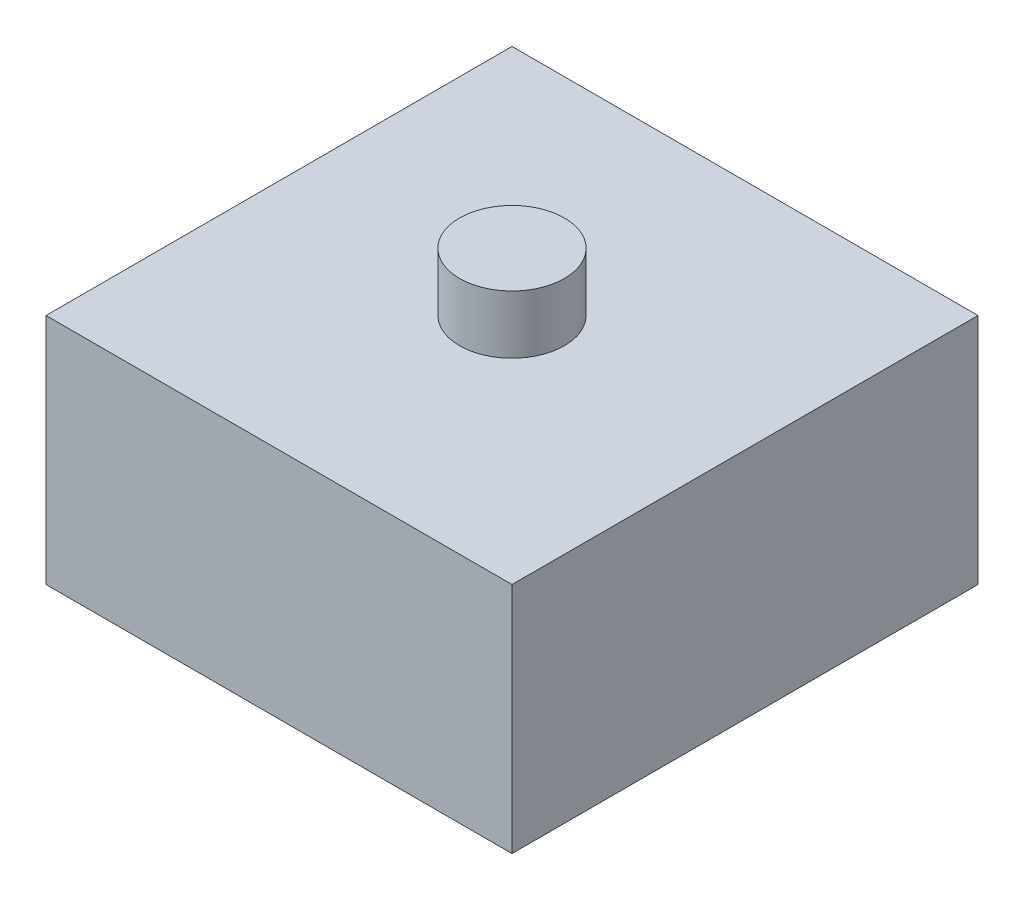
ISO-10303-21;
HEADER;
FILE_DESCRIPTION(('STEP AP214'),'2;1');
FILE_NAME('part.step','',(''),(''),'','','');
FILE_SCHEMA(('AUTOMOTIVE_DESIGN { 1 0 10303 214 1 1 1 1 }'));
ENDSEC;
DATA;
#1=APPLICATION_CONTEXT('core data for automotive mechanical design processes');
#2=APPLICATION_PROTOCOL_DEFINITION('international standard','automotive_design',2000,#1);
#3=PRODUCT_CONTEXT('',#1,'mechanical');
#4=PRODUCT('Part','Part','',(#3));
#5=PRODUCT_RELATED_PRODUCT_CATEGORY('part','',(#4));
#6=PRODUCT_DEFINITION_FORMATION('','',#4);
#7=PRODUCT_DEFINITION_CONTEXT('part definition',#1,'design');
#8=PRODUCT_DEFINITION('design','',#6,#7);
#9=PRODUCT_DEFINITION_SHAPE('','',#8);
#10=(LENGTH_UNIT() NAMED_UNIT(*) SI_UNIT(.MILLI.,.METRE.));
#11=(NAMED_UNIT(*) PLANE_ANGLE_UNIT() SI_UNIT($,.RADIAN.));
#12=(NAMED_UNIT(*) SI_UNIT($,.STERADIAN.) SOLID_ANGLE_UNIT());
#13=UNCERTAINTY_MEASURE_WITH_UNIT(LENGTH_MEASURE(1.E-05),#10,'distance_accuracy_value','');
#14=(GEOMETRIC_REPRESENTATION_CONTEXT(3) GLOBAL_UNCERTAINTY_ASSIGNED_CONTEXT((#13)) GLOBAL_UNIT_ASSIGNED_CONTEXT((#10,
#11,#12)) REPRESENTATION_CONTEXT('',''));
#15=CARTESIAN_POINT('',(0.,0.,0.));
#16=DIRECTION('',(0.,0.,1.));
#17=DIRECTION('',(1.,0.,0.));
#18=AXIS2_PLACEMENT_3D('',#15,#16,#17);
#19=CARTESIAN_POINT('',(-303.811551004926,-137.598737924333,400.));
#20=DIRECTION('',(0.,1.,0.));
#21=DIRECTION('',(0.,0.,1.));
#22=AXIS2_PLACEMENT_3D('',#19,#20,#21);
#23=PLANE('',#22);
#24=DIRECTION('',(1.,0.,0.));
#25=VECTOR('',#24,1.);
#26=CARTESIAN_POINT('',(-303.811551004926,-137.598737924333,0.));
#27=LINE('',#26,#25);
#28=CARTESIAN_POINT('',(-303.811551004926,-137.598737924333,0.));
#29=VERTEX_POINT('',#28);
#30=CARTESIAN_POINT('',(96.1884489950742,-137.598737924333,0.));
#31=VERTEX_POINT('',#30);
#32=EDGE_CURVE('E100',#29,#31,#27,.T.);
#33=ORIENTED_EDGE('',*,*,#32,.T.);
#34=DIRECTION('',(0.,0.,-1.));
#35=VECTOR('',#34,1.);
#36=CARTESIAN_POINT('',(96.1884489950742,-137.598737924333,400.));
#37=LINE('',#36,#35);
#38=CARTESIAN_POINT('',(96.1884489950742,-137.598737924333,400.));
#39=VERTEX_POINT('',#38);
#40=EDGE_CURVE('E38',#39,#31,#37,.T.);
#41=ORIENTED_EDGE('',*,*,#40,.F.);
#42=DIRECTION('',(1.,0.,0.));
#43=VECTOR('',#42,1.);
#44=CARTESIAN_POINT('',(-303.811551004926,-137.598737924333,400.));
#45=LINE('',#44,#43);
#46=CARTESIAN_POINT('',(-303.811551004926,-137.598737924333,400.));
#47=VERTEX_POINT('',#46);
#48=EDGE_CURVE('E76',#47,#39,#45,.T.);
#49=ORIENTED_EDGE('',*,*,#48,.F.);
#50=DIRECTION('',(0.,0.,-1.));
#51=VECTOR('',#50,1.);
#52=CARTESIAN_POINT('',(-303.811551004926,-137.598737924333,400.));
#53=LINE('',#52,#51);
#54=EDGE_CURVE('E96',#47,#29,#53,.T.);
#55=ORIENTED_EDGE('',*,*,#54,.T.);
#56=EDGE_LOOP('',(#33,#41,#49,#55));
#57=FACE_BOUND('',#56,.T.);
#58=ADVANCED_FACE('F35',(#57),#23,.F.);
#59=CARTESIAN_POINT('',(96.1884489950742,62.4012620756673,400.));
#60=DIRECTION('',(1.,0.,0.));
#61=DIRECTION('',(0.,1.,0.));
#62=AXIS2_PLACEMENT_3D('',#59,#60,#61);
#63=PLANE('',#62);
#64=DIRECTION('',(0.,-1.,0.));
#65=VECTOR('',#64,1.);
#66=CARTESIAN_POINT('',(96.1884489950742,62.4012620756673,0.));
#67=LINE('',#66,#65);
#68=CARTESIAN_POINT('',(96.1884489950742,62.4012620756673,0.));
#69=VERTEX_POINT('',#68);
#70=EDGE_CURVE('E86',#69,#31,#67,.T.);
#71=ORIENTED_EDGE('',*,*,#70,.F.);
#72=DIRECTION('',(0.,0.,-1.));
#73=VECTOR('',#72,1.);
#74=CARTESIAN_POINT('',(96.1884489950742,62.4012620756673,400.));
#75=LINE('',#74,#73);
#76=CARTESIAN_POINT('',(96.1884489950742,62.4012620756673,400.));
#77=VERTEX_POINT('',#76);
#78=EDGE_CURVE('E82',#77,#69,#75,.T.);
#79=ORIENTED_EDGE('',*,*,#78,.F.);
#80=DIRECTION('',(0.,-1.,0.));
#81=VECTOR('',#80,1.);
#82=CARTESIAN_POINT('',(96.1884489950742,62.4012620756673,400.));
#83=LINE('',#82,#81);
#84=EDGE_CURVE('E84',#77,#39,#83,.T.);
#85=ORIENTED_EDGE('',*,*,#84,.T.);
#86=ORIENTED_EDGE('',*,*,#40,.T.);
#87=EDGE_LOOP('',(#71,#79,#85,#86));
#88=FACE_BOUND('',#87,.T.);
#89=ADVANCED_FACE('F83',(#88),#63,.T.);
#90=CARTESIAN_POINT('',(-303.811551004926,62.4012620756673,400.));
#91=DIRECTION('',(0.,1.,0.));
#92=DIRECTION('',(0.,0.,1.));
#93=AXIS2_PLACEMENT_3D('',#90,#91,#92);
#94=PLANE('',#93);
#95=CARTESIAN_POINT('',(-103.811551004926,62.4012620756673,200.));
#96=DIRECTION('',(0.,1.,0.));
#97=DIRECTION('',(0.,0.,1.));
#98=AXIS2_PLACEMENT_3D('',#95,#96,#97);
#99=CIRCLE('',#98,45.);
#100=CARTESIAN_POINT('',(-103.811551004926,62.4012620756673,245.));
#101=VERTEX_POINT('',#100);
#102=EDGE_CURVE('E11',#101,#101,#99,.T.);
#103=ORIENTED_EDGE('',*,*,#102,.F.);
#104=EDGE_LOOP('',(#103));
#105=FACE_BOUND('',#104,.T.);
#106=DIRECTION('',(1.,0.,0.));
#107=VECTOR('',#106,1.);
#108=CARTESIAN_POINT('',(-303.811551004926,62.4012620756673,0.));
#109=LINE('',#108,#107);
#110=CARTESIAN_POINT('',(-303.811551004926,62.4012620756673,0.));
#111=VERTEX_POINT('',#110);
#112=EDGE_CURVE('E105',#111,#69,#109,.T.);
#113=ORIENTED_EDGE('',*,*,#112,.F.);
#114=DIRECTION('',(0.,0.,-1.));
#115=VECTOR('',#114,1.);
#116=CARTESIAN_POINT('',(-303.811551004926,62.4012620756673,400.));
#117=LINE('',#116,#115);
#118=CARTESIAN_POINT('',(-303.811551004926,62.4012620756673,400.));
#119=VERTEX_POINT('',#118);
#120=EDGE_CURVE('E68',#119,#111,#117,.T.);
#121=ORIENTED_EDGE('',*,*,#120,.F.);
#122=DIRECTION('',(1.,0.,0.));
#123=VECTOR('',#122,1.);
#124=CARTESIAN_POINT('',(-303.811551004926,62.4012620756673,400.));
#125=LINE('',#124,#123);
#126=EDGE_CURVE('E92',#119,#77,#125,.T.);
#127=ORIENTED_EDGE('',*,*,#126,.T.);
#128=ORIENTED_EDGE('',*,*,#78,.T.);
#129=EDGE_LOOP('',(#113,#121,#127,#128));
#130=FACE_BOUND('',#129,.T.);
#131=ADVANCED_FACE('F94',(#105,#130),#94,.T.);
#132=CARTESIAN_POINT('',(-303.811551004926,62.4012620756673,400.));
#133=DIRECTION('',(1.,0.,0.));
#134=DIRECTION('',(0.,0.,-1.));
#135=AXIS2_PLACEMENT_3D('',#132,#133,#134);
#136=PLANE('',#135);
#137=DIRECTION('',(0.,-1.,0.));
#138=VECTOR('',#137,1.);
#139=CARTESIAN_POINT('',(-303.811551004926,62.4012620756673,0.));
#140=LINE('',#139,#138);
#141=EDGE_CURVE('E71',#111,#29,#140,.T.);
#142=ORIENTED_EDGE('',*,*,#141,.T.);
#143=ORIENTED_EDGE('',*,*,#54,.F.);
#144=DIRECTION('',(0.,-1.,0.));
#145=VECTOR('',#144,1.);
#146=CARTESIAN_POINT('',(-303.811551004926,62.4012620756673,400.));
#147=LINE('',#146,#145);
#148=EDGE_CURVE('E52',#119,#47,#147,.T.);
#149=ORIENTED_EDGE('',*,*,#148,.F.);
#150=ORIENTED_EDGE('',*,*,#120,.T.);
#151=EDGE_LOOP('',(#142,#143,#149,#150));
#152=FACE_BOUND('',#151,.T.);
#153=ADVANCED_FACE('F123',(#152),#136,.F.);
#154=CARTESIAN_POINT('',(0.,0.,400.));
#155=DIRECTION('',(0.,0.,-1.));
#156=DIRECTION('',(-1.,0.,0.));
#157=AXIS2_PLACEMENT_3D('',#154,#155,#156);
#158=PLANE('',#157);
#159=ORIENTED_EDGE('',*,*,#48,.T.);
#160=ORIENTED_EDGE('',*,*,#84,.F.);
#161=ORIENTED_EDGE('',*,*,#126,.F.);
#162=ORIENTED_EDGE('',*,*,#148,.T.);
#163=EDGE_LOOP('',(#159,#160,#161,#162));
#164=FACE_BOUND('',#163,.T.);
#165=ADVANCED_FACE('F91',(#164),#158,.F.);
#166=CARTESIAN_POINT('',(0.,0.,0.));
#167=DIRECTION('',(0.,0.,-1.));
#168=DIRECTION('',(-1.,0.,0.));
#169=AXIS2_PLACEMENT_3D('',#166,#167,#168);
#170=PLANE('',#169);
#171=ORIENTED_EDGE('',*,*,#32,.F.);
#172=ORIENTED_EDGE('',*,*,#141,.F.);
#173=ORIENTED_EDGE('',*,*,#112,.T.);
#174=ORIENTED_EDGE('',*,*,#70,.T.);
#175=EDGE_LOOP('',(#171,#172,#173,#174));
#176=FACE_BOUND('',#175,.T.);
#177=ADVANCED_FACE('F112',(#176),#170,.T.);
#178=CARTESIAN_POINT('',(-103.811551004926,112.401262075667,200.));
#179=DIRECTION('',(0.,-1.,0.));
#180=DIRECTION('',(0.,0.,-1.));
#181=AXIS2_PLACEMENT_3D('',#178,#179,#180);
#182=CYLINDRICAL_SURFACE('',#181,45.);
#183=CARTESIAN_POINT('',(-103.811551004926,112.401262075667,200.));
#184=DIRECTION('',(0.,1.,0.));
#185=DIRECTION('',(0.,0.,1.));
#186=AXIS2_PLACEMENT_3D('',#183,#184,#185);
#187=CIRCLE('',#186,45.);
#188=CARTESIAN_POINT('',(-103.811551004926,112.401262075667,245.));
#189=VERTEX_POINT('',#188);
#190=EDGE_CURVE('E103',#189,#189,#187,.T.);
#191=ORIENTED_EDGE('',*,*,#190,.F.);
#192=EDGE_LOOP('',(#191));
#193=FACE_BOUND('',#192,.T.);
#194=ORIENTED_EDGE('',*,*,#102,.T.);
#195=EDGE_LOOP('',(#194));
#196=FACE_BOUND('',#195,.T.);
#197=ADVANCED_FACE('F114',(#193,#196),#182,.T.);
#198=CARTESIAN_POINT('',(-103.811551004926,112.401262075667,200.));
#199=DIRECTION('',(0.,1.,0.));
#200=DIRECTION('',(0.,0.,1.));
#201=AXIS2_PLACEMENT_3D('',#198,#199,#200);
#202=PLANE('',#201);
#203=ORIENTED_EDGE('',*,*,#190,.T.);
#204=EDGE_LOOP('',(#203));
#205=FACE_BOUND('',#204,.T.);
#206=ADVANCED_FACE('F120',(#205),#202,.T.);
#207=CLOSED_SHELL('',(#58,#89,#131,#153,#165,#177,#197,#206));
#208=MANIFOLD_SOLID_BREP('B2',#207);
#209=ADVANCED_BREP_SHAPE_REPRESENTATION('',(#18,#208),#14);
#210=SHAPE_DEFINITION_REPRESENTATION(#9,#209);
ENDSEC;
END-ISO-10303-21;
